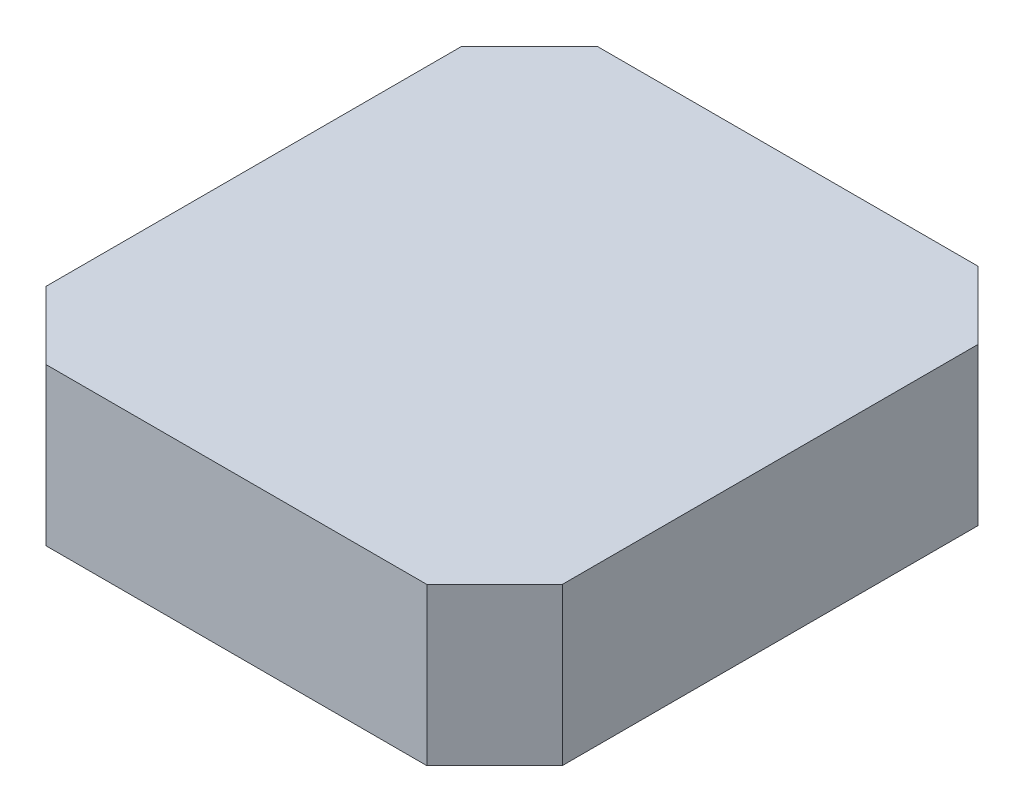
ISO-10303-21;
HEADER;
FILE_DESCRIPTION(('STEP AP214'),'2;1');
FILE_NAME('part.step','',(''),(''),'','','');
FILE_SCHEMA(('AUTOMOTIVE_DESIGN { 1 0 10303 214 1 1 1 1 }'));
ENDSEC;
DATA;
#1=APPLICATION_CONTEXT('core data for automotive mechanical design processes');
#2=APPLICATION_PROTOCOL_DEFINITION('international standard','automotive_design',2000,#1);
#3=PRODUCT_CONTEXT('',#1,'mechanical');
#4=PRODUCT('Part','Part','',(#3));
#5=PRODUCT_RELATED_PRODUCT_CATEGORY('part','',(#4));
#6=PRODUCT_DEFINITION_FORMATION('','',#4);
#7=PRODUCT_DEFINITION_CONTEXT('part definition',#1,'design');
#8=PRODUCT_DEFINITION('design','',#6,#7);
#9=PRODUCT_DEFINITION_SHAPE('','',#8);
#10=(LENGTH_UNIT() NAMED_UNIT(*) SI_UNIT(.MILLI.,.METRE.));
#11=(NAMED_UNIT(*) PLANE_ANGLE_UNIT() SI_UNIT($,.RADIAN.));
#12=(NAMED_UNIT(*) SI_UNIT($,.STERADIAN.) SOLID_ANGLE_UNIT());
#13=UNCERTAINTY_MEASURE_WITH_UNIT(LENGTH_MEASURE(1.E-05),#10,'distance_accuracy_value','');
#14=(GEOMETRIC_REPRESENTATION_CONTEXT(3) GLOBAL_UNCERTAINTY_ASSIGNED_CONTEXT((#13)) GLOBAL_UNIT_ASSIGNED_CONTEXT((#10,
#11,#12)) REPRESENTATION_CONTEXT('',''));
#15=CARTESIAN_POINT('',(0.,0.,0.));
#16=DIRECTION('',(0.,0.,1.));
#17=DIRECTION('',(1.,0.,0.));
#18=AXIS2_PLACEMENT_3D('',#15,#16,#17);
#19=CARTESIAN_POINT('',(5.45857864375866,4.5,-7.90000000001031));
#20=DIRECTION('',(-0.707106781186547,0.,0.707106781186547));
#21=DIRECTION('',(0.707106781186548,0.,0.707106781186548));
#22=AXIS2_PLACEMENT_3D('',#19,#20,#21);
#23=PLANE('',#22);
#24=DIRECTION('',(-0.707106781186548,0.,-0.707106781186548));
#25=VECTOR('',#24,1.);
#26=CARTESIAN_POINT('',(5.45857864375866,0.,-7.90000000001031));
#27=LINE('',#26,#25);
#28=CARTESIAN_POINT('',(7.39999999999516,0.,-5.95857864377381));
#29=VERTEX_POINT('',#28);
#30=CARTESIAN_POINT('',(5.45857864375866,0.,-7.90000000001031));
#31=VERTEX_POINT('',#30);
#32=EDGE_CURVE('E129',#29,#31,#27,.T.);
#33=ORIENTED_EDGE('',*,*,#32,.T.);
#34=DIRECTION('',(0.,-1.,0.));
#35=VECTOR('',#34,1.);
#36=CARTESIAN_POINT('',(5.45857864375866,4.5,-7.90000000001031));
#37=LINE('',#36,#35);
#38=CARTESIAN_POINT('',(5.45857864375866,4.5,-7.90000000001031));
#39=VERTEX_POINT('',#38);
#40=EDGE_CURVE('E11',#39,#31,#37,.T.);
#41=ORIENTED_EDGE('',*,*,#40,.F.);
#42=DIRECTION('',(-0.707106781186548,0.,-0.707106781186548));
#43=VECTOR('',#42,1.);
#44=CARTESIAN_POINT('',(5.45857864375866,4.5,-7.90000000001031));
#45=LINE('',#44,#43);
#46=CARTESIAN_POINT('',(7.39999999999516,4.5,-5.95857864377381));
#47=VERTEX_POINT('',#46);
#48=EDGE_CURVE('E143',#47,#39,#45,.T.);
#49=ORIENTED_EDGE('',*,*,#48,.F.);
#50=DIRECTION('',(0.,-1.,0.));
#51=VECTOR('',#50,1.);
#52=CARTESIAN_POINT('',(7.39999999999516,4.5,-5.95857864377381));
#53=LINE('',#52,#51);
#54=EDGE_CURVE('E125',#47,#29,#53,.T.);
#55=ORIENTED_EDGE('',*,*,#54,.T.);
#56=EDGE_LOOP('',(#33,#41,#49,#55));
#57=FACE_BOUND('',#56,.T.);
#58=ADVANCED_FACE('F33',(#57),#23,.F.);
#59=CARTESIAN_POINT('',(5.45857864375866,4.5,-7.90000000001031));
#60=DIRECTION('',(0.,0.,1.));
#61=DIRECTION('',(1.,0.,0.));
#62=AXIS2_PLACEMENT_3D('',#59,#60,#61);
#63=PLANE('',#62);
#64=DIRECTION('',(-1.,0.,0.));
#65=VECTOR('',#64,1.);
#66=CARTESIAN_POINT('',(5.45857864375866,0.,-7.90000000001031));
#67=LINE('',#66,#65);
#68=CARTESIAN_POINT('',(-5.4585786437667,0.,-7.90000000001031));
#69=VERTEX_POINT('',#68);
#70=EDGE_CURVE('E132',#31,#69,#67,.T.);
#71=ORIENTED_EDGE('',*,*,#70,.T.);
#72=DIRECTION('',(0.,-1.,0.));
#73=VECTOR('',#72,1.);
#74=CARTESIAN_POINT('',(-5.4585786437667,4.5,-7.90000000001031));
#75=LINE('',#74,#73);
#76=CARTESIAN_POINT('',(-5.4585786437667,4.5,-7.90000000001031));
#77=VERTEX_POINT('',#76);
#78=EDGE_CURVE('E41',#77,#69,#75,.T.);
#79=ORIENTED_EDGE('',*,*,#78,.F.);
#80=DIRECTION('',(-1.,0.,0.));
#81=VECTOR('',#80,1.);
#82=CARTESIAN_POINT('',(5.45857864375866,4.5,-7.90000000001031));
#83=LINE('',#82,#81);
#84=EDGE_CURVE('E92',#39,#77,#83,.T.);
#85=ORIENTED_EDGE('',*,*,#84,.F.);
#86=ORIENTED_EDGE('',*,*,#40,.T.);
#87=EDGE_LOOP('',(#71,#79,#85,#86));
#88=FACE_BOUND('',#87,.T.);
#89=ADVANCED_FACE('F178',(#88),#63,.F.);
#90=CARTESIAN_POINT('',(-5.4585786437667,4.5,-7.90000000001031));
#91=DIRECTION('',(0.707106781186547,0.,0.707106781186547));
#92=DIRECTION('',(0.707106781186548,0.,-0.707106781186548));
#93=AXIS2_PLACEMENT_3D('',#90,#91,#92);
#94=PLANE('',#93);
#95=DIRECTION('',(-0.707106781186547,0.,0.707106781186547));
#96=VECTOR('',#95,1.);
#97=CARTESIAN_POINT('',(-5.4585786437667,0.,-7.90000000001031));
#98=LINE('',#97,#96);
#99=CARTESIAN_POINT('',(-7.39999999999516,0.,-5.95857864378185));
#100=VERTEX_POINT('',#99);
#101=EDGE_CURVE('E134',#69,#100,#98,.T.);
#102=ORIENTED_EDGE('',*,*,#101,.T.);
#103=DIRECTION('',(0.,-1.,0.));
#104=VECTOR('',#103,1.);
#105=CARTESIAN_POINT('',(-7.39999999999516,4.5,-5.95857864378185));
#106=LINE('',#105,#104);
#107=CARTESIAN_POINT('',(-7.39999999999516,4.5,-5.95857864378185));
#108=VERTEX_POINT('',#107);
#109=EDGE_CURVE('E150',#108,#100,#106,.T.);
#110=ORIENTED_EDGE('',*,*,#109,.F.);
#111=DIRECTION('',(-0.707106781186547,0.,0.707106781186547));
#112=VECTOR('',#111,1.);
#113=CARTESIAN_POINT('',(-5.4585786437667,4.5,-7.90000000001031));
#114=LINE('',#113,#112);
#115=EDGE_CURVE('E158',#77,#108,#114,.T.);
#116=ORIENTED_EDGE('',*,*,#115,.F.);
#117=ORIENTED_EDGE('',*,*,#78,.T.);
#118=EDGE_LOOP('',(#102,#110,#116,#117));
#119=FACE_BOUND('',#118,.T.);
#120=ADVANCED_FACE('F156',(#119),#94,.F.);
#121=CARTESIAN_POINT('',(-7.39999999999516,4.5,-5.95857864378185));
#122=DIRECTION('',(1.,0.,0.));
#123=DIRECTION('',(0.,0.,-1.));
#124=AXIS2_PLACEMENT_3D('',#121,#122,#123);
#125=PLANE('',#124);
#126=DIRECTION('',(0.,0.,1.));
#127=VECTOR('',#126,1.);
#128=CARTESIAN_POINT('',(-7.39999999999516,0.,-5.95857864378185));
#129=LINE('',#128,#127);
#130=CARTESIAN_POINT('',(-7.39999999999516,0.,5.95857864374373));
#131=VERTEX_POINT('',#130);
#132=EDGE_CURVE('E136',#100,#131,#129,.T.);
#133=ORIENTED_EDGE('',*,*,#132,.T.);
#134=DIRECTION('',(0.,-1.,0.));
#135=VECTOR('',#134,1.);
#136=CARTESIAN_POINT('',(-7.39999999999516,4.5,5.95857864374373));
#137=LINE('',#136,#135);
#138=CARTESIAN_POINT('',(-7.39999999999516,4.5,5.95857864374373));
#139=VERTEX_POINT('',#138);
#140=EDGE_CURVE('E147',#139,#131,#137,.T.);
#141=ORIENTED_EDGE('',*,*,#140,.F.);
#142=DIRECTION('',(0.,0.,1.));
#143=VECTOR('',#142,1.);
#144=CARTESIAN_POINT('',(-7.39999999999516,4.5,-5.95857864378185));
#145=LINE('',#144,#143);
#146=EDGE_CURVE('E170',#108,#139,#145,.T.);
#147=ORIENTED_EDGE('',*,*,#146,.F.);
#148=ORIENTED_EDGE('',*,*,#109,.T.);
#149=EDGE_LOOP('',(#133,#141,#147,#148));
#150=FACE_BOUND('',#149,.T.);
#151=ADVANCED_FACE('F166',(#150),#125,.F.);
#152=CARTESIAN_POINT('',(-5.45857864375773,4.5,7.89999999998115));
#153=DIRECTION('',(0.707106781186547,0.,-0.707106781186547));
#154=DIRECTION('',(-0.707106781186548,0.,-0.707106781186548));
#155=AXIS2_PLACEMENT_3D('',#152,#153,#154);
#156=PLANE('',#155);
#157=DIRECTION('',(0.707106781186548,0.,0.707106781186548));
#158=VECTOR('',#157,1.);
#159=CARTESIAN_POINT('',(-5.45857864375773,0.,7.89999999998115));
#160=LINE('',#159,#158);
#161=CARTESIAN_POINT('',(-5.45857864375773,0.,7.89999999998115));
#162=VERTEX_POINT('',#161);
#163=EDGE_CURVE('E138',#131,#162,#160,.T.);
#164=ORIENTED_EDGE('',*,*,#163,.T.);
#165=DIRECTION('',(0.,-1.,0.));
#166=VECTOR('',#165,1.);
#167=CARTESIAN_POINT('',(-5.45857864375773,4.5,7.89999999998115));
#168=LINE('',#167,#166);
#169=CARTESIAN_POINT('',(-5.45857864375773,4.5,7.89999999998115));
#170=VERTEX_POINT('',#169);
#171=EDGE_CURVE('E120',#170,#162,#168,.T.);
#172=ORIENTED_EDGE('',*,*,#171,.F.);
#173=DIRECTION('',(0.707106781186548,0.,0.707106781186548));
#174=VECTOR('',#173,1.);
#175=CARTESIAN_POINT('',(-5.45857864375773,4.5,7.89999999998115));
#176=LINE('',#175,#174);
#177=EDGE_CURVE('E111',#139,#170,#176,.T.);
#178=ORIENTED_EDGE('',*,*,#177,.F.);
#179=ORIENTED_EDGE('',*,*,#140,.T.);
#180=EDGE_LOOP('',(#164,#172,#178,#179));
#181=FACE_BOUND('',#180,.T.);
#182=ADVANCED_FACE('F169',(#181),#156,.F.);
#183=CARTESIAN_POINT('',(5.45857864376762,4.5,7.89999999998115));
#184=DIRECTION('',(0.,0.,-1.));
#185=DIRECTION('',(-1.,0.,0.));
#186=AXIS2_PLACEMENT_3D('',#183,#184,#185);
#187=PLANE('',#186);
#188=DIRECTION('',(1.,0.,0.));
#189=VECTOR('',#188,1.);
#190=CARTESIAN_POINT('',(5.45857864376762,0.,7.89999999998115));
#191=LINE('',#190,#189);
#192=CARTESIAN_POINT('',(5.45857864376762,0.,7.89999999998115));
#193=VERTEX_POINT('',#192);
#194=EDGE_CURVE('E119',#162,#193,#191,.T.);
#195=ORIENTED_EDGE('',*,*,#194,.T.);
#196=DIRECTION('',(0.,-1.,0.));
#197=VECTOR('',#196,1.);
#198=CARTESIAN_POINT('',(5.45857864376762,4.5,7.89999999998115));
#199=LINE('',#198,#197);
#200=CARTESIAN_POINT('',(5.45857864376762,4.5,7.89999999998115));
#201=VERTEX_POINT('',#200);
#202=EDGE_CURVE('E116',#201,#193,#199,.T.);
#203=ORIENTED_EDGE('',*,*,#202,.F.);
#204=DIRECTION('',(1.,0.,0.));
#205=VECTOR('',#204,1.);
#206=CARTESIAN_POINT('',(5.45857864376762,4.5,7.89999999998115));
#207=LINE('',#206,#205);
#208=EDGE_CURVE('E105',#170,#201,#207,.T.);
#209=ORIENTED_EDGE('',*,*,#208,.F.);
#210=ORIENTED_EDGE('',*,*,#171,.T.);
#211=EDGE_LOOP('',(#195,#203,#209,#210));
#212=FACE_BOUND('',#211,.T.);
#213=ADVANCED_FACE('F117',(#212),#187,.F.);
#214=CARTESIAN_POINT('',(7.39999999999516,4.5,5.95857864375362));
#215=DIRECTION('',(-0.707106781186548,0.,-0.707106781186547));
#216=DIRECTION('',(-0.707106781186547,0.,0.707106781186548));
#217=AXIS2_PLACEMENT_3D('',#214,#215,#216);
#218=PLANE('',#217);
#219=DIRECTION('',(0.707106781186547,0.,-0.707106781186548));
#220=VECTOR('',#219,1.);
#221=CARTESIAN_POINT('',(7.39999999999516,0.,5.95857864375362));
#222=LINE('',#221,#220);
#223=CARTESIAN_POINT('',(7.39999999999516,0.,5.95857864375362));
#224=VERTEX_POINT('',#223);
#225=EDGE_CURVE('E78',#193,#224,#222,.T.);
#226=ORIENTED_EDGE('',*,*,#225,.T.);
#227=DIRECTION('',(0.,-1.,0.));
#228=VECTOR('',#227,1.);
#229=CARTESIAN_POINT('',(7.39999999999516,4.5,5.95857864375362));
#230=LINE('',#229,#228);
#231=CARTESIAN_POINT('',(7.39999999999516,4.5,5.95857864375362));
#232=VERTEX_POINT('',#231);
#233=EDGE_CURVE('E121',#232,#224,#230,.T.);
#234=ORIENTED_EDGE('',*,*,#233,.F.);
#235=DIRECTION('',(0.707106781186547,0.,-0.707106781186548));
#236=VECTOR('',#235,1.);
#237=CARTESIAN_POINT('',(7.39999999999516,4.5,5.95857864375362));
#238=LINE('',#237,#236);
#239=EDGE_CURVE('E109',#201,#232,#238,.T.);
#240=ORIENTED_EDGE('',*,*,#239,.F.);
#241=ORIENTED_EDGE('',*,*,#202,.T.);
#242=EDGE_LOOP('',(#226,#234,#240,#241));
#243=FACE_BOUND('',#242,.T.);
#244=ADVANCED_FACE('F123',(#243),#218,.F.);
#245=CARTESIAN_POINT('',(7.39999999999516,4.5,-5.95857864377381));
#246=DIRECTION('',(-1.,0.,0.));
#247=DIRECTION('',(0.,0.,1.));
#248=AXIS2_PLACEMENT_3D('',#245,#246,#247);
#249=PLANE('',#248);
#250=DIRECTION('',(0.,0.,-1.));
#251=VECTOR('',#250,1.);
#252=CARTESIAN_POINT('',(7.39999999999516,0.,-5.95857864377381));
#253=LINE('',#252,#251);
#254=EDGE_CURVE('E84',#224,#29,#253,.T.);
#255=ORIENTED_EDGE('',*,*,#254,.T.);
#256=ORIENTED_EDGE('',*,*,#54,.F.);
#257=DIRECTION('',(0.,0.,-1.));
#258=VECTOR('',#257,1.);
#259=CARTESIAN_POINT('',(7.39999999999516,4.5,-5.95857864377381));
#260=LINE('',#259,#258);
#261=EDGE_CURVE('E49',#232,#47,#260,.T.);
#262=ORIENTED_EDGE('',*,*,#261,.F.);
#263=ORIENTED_EDGE('',*,*,#233,.T.);
#264=EDGE_LOOP('',(#255,#256,#262,#263));
#265=FACE_BOUND('',#264,.T.);
#266=ADVANCED_FACE('F194',(#265),#249,.F.);
#267=CARTESIAN_POINT('',(0.,4.5,0.));
#268=DIRECTION('',(0.,-1.,0.));
#269=DIRECTION('',(0.,0.,-1.));
#270=AXIS2_PLACEMENT_3D('',#267,#268,#269);
#271=PLANE('',#270);
#272=ORIENTED_EDGE('',*,*,#48,.T.);
#273=ORIENTED_EDGE('',*,*,#84,.T.);
#274=ORIENTED_EDGE('',*,*,#115,.T.);
#275=ORIENTED_EDGE('',*,*,#146,.T.);
#276=ORIENTED_EDGE('',*,*,#177,.T.);
#277=ORIENTED_EDGE('',*,*,#208,.T.);
#278=ORIENTED_EDGE('',*,*,#239,.T.);
#279=ORIENTED_EDGE('',*,*,#261,.T.);
#280=EDGE_LOOP('',(#272,#273,#274,#275,#276,#277,#278,#279));
#281=FACE_BOUND('',#280,.T.);
#282=ADVANCED_FACE('F107',(#281),#271,.F.);
#283=CARTESIAN_POINT('',(0.,0.,0.));
#284=DIRECTION('',(0.,-1.,0.));
#285=DIRECTION('',(0.,0.,-1.));
#286=AXIS2_PLACEMENT_3D('',#283,#284,#285);
#287=PLANE('',#286);
#288=ORIENTED_EDGE('',*,*,#32,.F.);
#289=ORIENTED_EDGE('',*,*,#254,.F.);
#290=ORIENTED_EDGE('',*,*,#225,.F.);
#291=ORIENTED_EDGE('',*,*,#194,.F.);
#292=ORIENTED_EDGE('',*,*,#163,.F.);
#293=ORIENTED_EDGE('',*,*,#132,.F.);
#294=ORIENTED_EDGE('',*,*,#101,.F.);
#295=ORIENTED_EDGE('',*,*,#70,.F.);
#296=EDGE_LOOP('',(#288,#289,#290,#291,#292,#293,#294,#295));
#297=FACE_BOUND('',#296,.T.);
#298=ADVANCED_FACE('F162',(#297),#287,.T.);
#299=CLOSED_SHELL('',(#58,#89,#120,#151,#182,#213,#244,#266,#282,#298));
#300=MANIFOLD_SOLID_BREP('B2',#299);
#301=ADVANCED_BREP_SHAPE_REPRESENTATION('',(#18,#300),#14);
#302=SHAPE_DEFINITION_REPRESENTATION(#9,#301);
ENDSEC;
END-ISO-10303-21;
